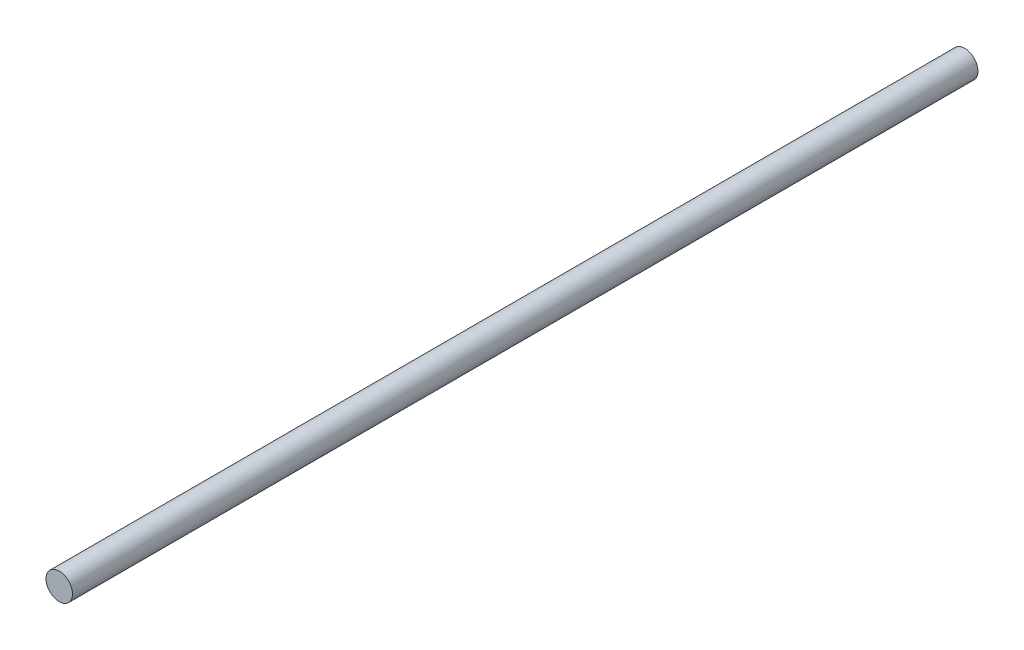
from build123d import *

# Parameters (mm, degrees)
SKETCH1_R           = 30
BOSS_EXTRUDE1_DEPTH = 2050


with BuildPart() as part:
    # Sketch1 → Boss-Extrude1 (new body)
    with BuildSketch(Plane.XY):
        Circle(SKETCH1_R)
    extrude(amount=-BOSS_EXTRUDE1_DEPTH)


solid = part.part
